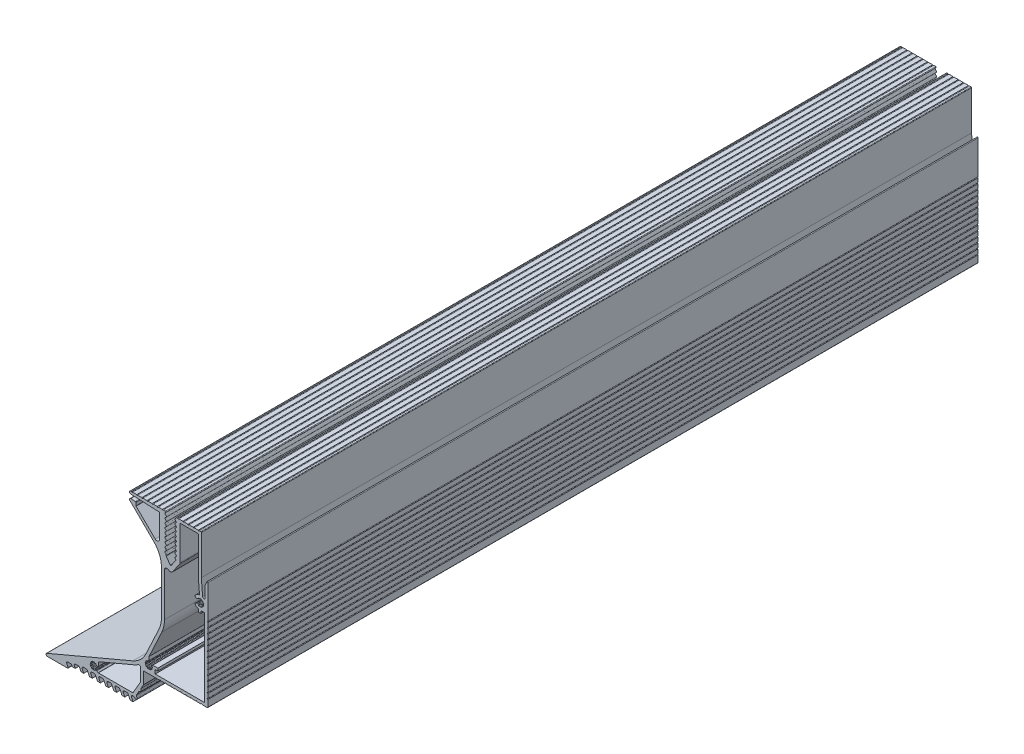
from build123d import *

# Parameters (mm, degrees)
EXTRUDE_1_DEPTH = 300


with BuildPart() as part:
    # Model → Extrude 1 (new body)
    with BuildSketch(Plane.XY):
        with BuildLine():
            Line((322.831339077, 468.657038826), (323.237241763, 468.657057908))
            ThreePointArc((323.237241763, 468.657057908), (323.437241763, 468.457057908), (323.637241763, 468.657057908))
            Line((323.637241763, 468.657057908), (325.237241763, 468.657057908))
            ThreePointArc((325.237241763, 468.657057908), (325.437241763, 468.457057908), (325.637241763, 468.657057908))
            Line((325.637241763, 468.657057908), (327.237241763, 468.657057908))
            ThreePointArc((327.237241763, 468.657057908), (327.437241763, 468.457057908), (327.637241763, 468.657057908))
            Line((327.637241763, 468.657057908), (329.237241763, 468.657057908))
            ThreePointArc((329.237241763, 468.657057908), (329.437241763, 468.457057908), (329.637241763, 468.657057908))
            Line((329.637241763, 468.657057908), (331.241359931, 468.657057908))
            ThreePointArc((331.241359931, 468.657057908), (331.441359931, 468.457057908), (331.641359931, 468.657057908))
            Line((331.641359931, 468.657057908), (332.221359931, 468.657057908))
            ThreePointArc((332.221359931, 468.657057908), (332.362781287, 468.598479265), (332.421359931, 468.457057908))
            Line((332.421359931, 468.457057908), (332.421359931, 453.22413918))
            ThreePointArc((332.421359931, 453.22413918), (332.421519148, 453.216160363), (332.421996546, 453.20819425))
            Line((332.421996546, 453.20819425), (332.909102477, 447.117789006))
            ThreePointArc((332.909102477, 447.117789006), (333.435438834, 446.631867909), (333.921359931, 447.158204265))
            Line((333.921359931, 447.158204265), (333.921359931, 451.445025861))
            ThreePointArc((333.921359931, 451.445025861), (333.92580803, 451.486971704), (333.938954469, 451.527051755))
            Line((333.938954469, 451.527051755), (334.538954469, 452.861304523))
            ThreePointArc((334.538954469, 452.861304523), (334.771170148, 453.011494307), (334.921359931, 452.779278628))
            Line((334.921359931, 452.779278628), (334.921359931, 439.737948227))
            ThreePointArc((334.921359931, 439.737948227), (334.721359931, 439.537948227), (334.921359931, 439.337948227))
            Line((334.921359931, 439.337948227), (334.921359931, 437.737948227))
            ThreePointArc((334.921359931, 437.737948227), (334.721359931, 437.537948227), (334.921359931, 437.337948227))
            Line((334.921359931, 437.337948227), (334.921359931, 435.737948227))
            ThreePointArc((334.921359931, 435.737948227), (334.721359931, 435.537948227), (334.921359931, 435.337948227))
            Line((334.921359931, 435.337948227), (334.921359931, 433.737948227))
            ThreePointArc((334.921359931, 433.737948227), (334.721359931, 433.537948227), (334.921359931, 433.337948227))
            Line((334.921359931, 433.337948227), (334.921359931, 431.737948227))
            ThreePointArc((334.921359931, 431.737948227), (334.721359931, 431.537948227), (334.921359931, 431.337948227))
            Line((334.921359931, 431.337948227), (334.921359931, 429.737948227))
            ThreePointArc((334.921359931, 429.737948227), (334.721359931, 429.537948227), (334.921359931, 429.337948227))
            Line((334.921359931, 429.337948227), (334.921359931, 427.737948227))
            ThreePointArc((334.921359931, 427.737948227), (334.721359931, 427.537948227), (334.921359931, 427.337948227))
            Line((334.921359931, 427.337948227), (334.921359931, 425.737948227))
            ThreePointArc((334.921359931, 425.737948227), (334.721359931, 425.537948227), (334.921359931, 425.337948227))
            Line((334.921359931, 425.337948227), (334.921359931, 423.737948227))
            ThreePointArc((334.921359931, 423.737948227), (334.721359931, 423.537948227), (334.921359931, 423.337948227))
            Line((334.921359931, 423.337948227), (334.921359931, 421.737948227))
            ThreePointArc((334.921359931, 421.737948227), (334.721359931, 421.537948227), (334.921359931, 421.337948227))
            Line((334.921359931, 421.337948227), (334.921359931, 419.737948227))
            ThreePointArc((334.921359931, 419.737948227), (334.721359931, 419.537948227), (334.921359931, 419.337948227))
            Line((334.921359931, 419.337948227), (334.921359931, 417.737948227))
            ThreePointArc((334.921359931, 417.737948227), (334.721359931, 417.537948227), (334.921359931, 417.337948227))
            Line((334.921359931, 417.337948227), (334.921359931, 415.737948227))
            ThreePointArc((334.921359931, 415.737948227), (334.721359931, 415.537948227), (334.921359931, 415.337948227))
            Line((334.921359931, 415.337948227), (334.921359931, 413.737948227))
            ThreePointArc((334.921359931, 413.737948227), (334.721359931, 413.537948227), (334.921359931, 413.337948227))
            Line((334.921359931, 413.337948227), (334.921359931, 410.737948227))
            ThreePointArc((334.921359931, 410.737948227), (334.862781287, 410.596526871), (334.721359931, 410.537948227))
            Line((334.721359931, 410.537948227), (332.641359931, 410.537948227))
            ThreePointArc((332.641359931, 410.537948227), (332.441359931, 410.737948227), (332.241359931, 410.537948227))
            Line((332.241359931, 410.537948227), (330.644401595, 410.537948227))
            ThreePointArc((330.644401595, 410.537948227), (330.444401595, 410.737948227), (330.244401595, 410.537948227))
            Line((330.244401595, 410.537948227), (328.644401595, 410.537948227))
            ThreePointArc((328.644401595, 410.537948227), (328.444401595, 410.737948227), (328.244401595, 410.537948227))
            Line((328.244401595, 410.537948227), (326.644401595, 410.537948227))
            ThreePointArc((326.644401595, 410.537948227), (326.444401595, 410.737948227), (326.244401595, 410.537948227))
            Line((326.244401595, 410.537948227), (324.644401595, 410.537948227))
            ThreePointArc((324.644401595, 410.537948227), (324.444401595, 410.737948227), (324.244401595, 410.537948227))
            Line((324.244401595, 410.537948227), (322.644401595, 410.537948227))
            ThreePointArc((322.644401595, 410.537948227), (322.444401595, 410.737948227), (322.244401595, 410.537948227))
            Line((322.244401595, 410.537948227), (320.644401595, 410.537948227))
            ThreePointArc((320.644401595, 410.537948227), (320.444401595, 410.737948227), (320.244401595, 410.537948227))
            Line((320.244401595, 410.537948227), (318.644401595, 410.537948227))
            ThreePointArc((318.644401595, 410.537948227), (318.444401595, 410.737948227), (318.244401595, 410.537948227))
            Line((318.244401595, 410.537948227), (316.644401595, 410.537948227))
            ThreePointArc((316.644401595, 410.537948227), (316.444401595, 410.737948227), (316.244401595, 410.537948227))
            Line((316.244401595, 410.537948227), (310.121359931, 410.537948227))
            ThreePointArc((310.121359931, 410.537948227), (309.979938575, 410.479369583), (309.921359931, 410.337948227))
            Line((309.921359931, 410.337948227), (309.921359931, 405.899680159))
            ThreePointArc((309.921359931, 405.899680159), (309.914545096, 405.84791635), (309.894565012, 405.799680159))
            Line((309.894565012, 405.799680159), (308.894300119, 404.067170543))
            ThreePointArc((308.894300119, 404.067170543), (308.827396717, 403.826329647), (308.885433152, 403.583199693))
            ThreePointArc((308.885433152, 403.583199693), (308.876566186, 403.099228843), (308.461868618, 402.8495644))
            ThreePointArc((308.461868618, 402.8495644), (308.222293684, 402.778260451), (308.047171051, 402.599899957))
            Line((308.047171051, 402.599899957), (307.190892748, 401.116782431))
            ThreePointArc((307.190892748, 401.116782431), (307.124381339, 400.888592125), (307.170751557, 400.6554733))
            Line((307.170751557, 400.6554733), (307.401333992, 400.160987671))
            ThreePointArc((307.401333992, 400.160987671), (307.15948923, 399.496524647), (306.495026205, 399.738369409))
            Line((306.495026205, 399.738369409), (306.489778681, 399.749622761))
            ThreePointArc((306.489778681, 399.749622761), (306.305274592, 399.960009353), (306.036624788, 400.038313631))
            Line((306.036624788, 400.038313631), (305.63289134, 400.038313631))
            ThreePointArc((305.63289134, 400.038313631), (305.211195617, 399.806963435), (305.179737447, 399.3270045))
            Line((305.179737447, 399.3270045), (305.780834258, 398.037948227))
            Line((305.780834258, 398.037948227), (304.677456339, 398.037948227))
            Line((304.677456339, 398.037948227), (303.879289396, 399.749622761))
            ThreePointArc((303.879289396, 399.749622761), (303.694785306, 399.960009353), (303.426135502, 400.038313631))
            Line((303.426135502, 400.038313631), (302.46389134, 400.038313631))
            ThreePointArc((302.46389134, 400.038313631), (302.042195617, 399.806963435), (302.010737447, 399.3270045))
            Line((302.010737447, 399.3270045), (302.611834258, 398.037948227))
            Line((302.611834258, 398.037948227), (301.508456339, 398.037948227))
            Line((301.508456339, 398.037948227), (300.710289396, 399.749622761))
            ThreePointArc((300.710289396, 399.749622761), (300.525785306, 399.960009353), (300.257135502, 400.038313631))
            Line((300.257135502, 400.038313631), (299.29489134, 400.038313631))
            ThreePointArc((299.29489134, 400.038313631), (298.873195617, 399.806963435), (298.841737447, 399.3270045))
            Line((298.841737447, 399.3270045), (299.442834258, 398.037948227))
            Line((299.442834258, 398.037948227), (298.339456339, 398.037948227))
            Line((298.339456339, 398.037948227), (297.541289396, 399.749622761))
            ThreePointArc((297.541289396, 399.749622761), (297.356785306, 399.960009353), (297.088135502, 400.038313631))
            Line((297.088135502, 400.038313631), (296.12589134, 400.038313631))
            ThreePointArc((296.12589134, 400.038313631), (295.704195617, 399.806963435), (295.672737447, 399.3270045))
            Line((295.672737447, 399.3270045), (296.273834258, 398.037948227))
            Line((296.273834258, 398.037948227), (295.170456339, 398.037948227))
            Line((295.170456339, 398.037948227), (294.372289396, 399.749622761))
            ThreePointArc((294.372289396, 399.749622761), (294.187785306, 399.960009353), (293.919135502, 400.038313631))
            Line((293.919135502, 400.038313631), (292.95689134, 400.038313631))
            ThreePointArc((292.95689134, 400.038313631), (292.535195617, 399.806963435), (292.503737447, 399.3270045))
            Line((292.503737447, 399.3270045), (293.104834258, 398.037948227))
            Line((293.104834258, 398.037948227), (292.001456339, 398.037948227))
            Line((292.001456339, 398.037948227), (291.203289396, 399.749622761))
            ThreePointArc((291.203289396, 399.749622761), (291.018785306, 399.960009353), (290.750135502, 400.038313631))
            Line((290.750135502, 400.038313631), (289.78789134, 400.038313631))
            ThreePointArc((289.78789134, 400.038313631), (289.366195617, 399.806963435), (289.334737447, 399.3270045))
            Line((289.334737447, 399.3270045), (289.935834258, 398.037948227))
            Line((289.935834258, 398.037948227), (288.832456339, 398.037948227))
            Line((288.832456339, 398.037948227), (288.034289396, 399.749622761))
            ThreePointArc((288.034289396, 399.749622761), (287.849785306, 399.960009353), (287.581135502, 400.038313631))
            Line((287.581135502, 400.038313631), (286.477757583, 400.038313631))
            ThreePointArc((286.477757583, 400.038313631), (286.05606186, 399.806963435), (286.02460369, 399.3270045))
            Line((286.02460369, 399.3270045), (286.625700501, 398.037948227))
            Line((286.625700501, 398.037948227), (285.522322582, 398.037948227))
            Line((285.522322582, 398.037948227), (284.952095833, 399.260803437))
            ThreePointArc((284.952095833, 399.260803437), (284.767591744, 399.471190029), (284.49894194, 399.549494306))
            Line((284.49894194, 399.549494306), (283.395564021, 399.549494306))
            ThreePointArc((283.395564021, 399.549494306), (282.973868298, 399.31814411), (282.942410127, 398.838185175))
            Line((282.942410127, 398.838185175), (283.315566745, 398.037948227))
            Line((283.315566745, 398.037948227), (282.212188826, 398.037948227))
            Line((282.212188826, 398.037948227), (281.994384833, 398.505030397))
            ThreePointArc((281.994384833, 398.505030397), (281.809880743, 398.715416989), (281.541230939, 398.793721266))
            Line((281.541230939, 398.793721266), (280.43785302, 398.793721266))
            ThreePointArc((280.43785302, 398.793721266), (280.016157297, 398.562371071), (279.984699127, 398.082412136))
            Line((279.984699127, 398.082412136), (280.518767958, 396.937097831))
            ThreePointArc((280.518767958, 396.937097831), (280.50618469, 396.745114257), (280.337506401, 396.652574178))
            Line((280.337506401, 396.652574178), (272.418156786, 396.652574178))
            ThreePointArc((272.418156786, 396.652574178), (271.92816661, 397.053027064), (272.223048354, 397.612935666))
            Line((272.223048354, 397.612935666), (305.721136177, 411.809951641))
            ThreePointArc((305.721136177, 411.809951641), (308.763541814, 413.821843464), (310.882045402, 416.790998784))
            Line((310.882045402, 416.790998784), (315.924437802, 427.604444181))
            ThreePointArc((315.924437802, 427.604444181), (316.624320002, 429.666230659), (316.861359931, 431.830626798))
            Line((316.861359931, 431.830626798), (316.861359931, 449.047517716))
            ThreePointArc((316.861359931, 449.047517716), (316.085510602, 452.909517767), (313.878351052, 456.172251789))
            Line((313.878351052, 456.172251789), (304.61185251, 465.298618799))
            ThreePointArc((304.61185251, 465.298618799), (304.504115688, 465.854100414), (304.983675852, 466.154415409))
            Line((304.983675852, 466.154415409), (306.77109158, 466.079371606))
            ThreePointArc((306.77109158, 466.079371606), (306.907059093, 466.017971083), (306.962702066, 465.879547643))
            Line((306.962702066, 465.879547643), (306.962702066, 464.751329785))
            ThreePointArc((306.962702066, 464.751329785), (306.978219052, 464.674089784), (307.022362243, 464.608835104))
            Line((307.022362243, 464.608835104), (314.459660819, 457.284006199))
            ThreePointArc((314.459660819, 457.284006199), (315.547559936, 457.074064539), (316.161359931, 457.996479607))
            Line((316.161359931, 457.996479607), (316.161359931, 466.99466779))
            ThreePointArc((316.161359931, 466.99466779), (316.105716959, 467.133091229), (315.969749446, 467.194491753))
            Line((315.969749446, 467.194491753), (304.941728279, 467.657498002))
            ThreePointArc((304.941728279, 467.657498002), (304.452435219, 468.167764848), (304.962702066, 468.657057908))
            Line((304.962702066, 468.657057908), (305.262702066, 468.657057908))
            ThreePointArc((305.262702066, 468.657057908), (305.462702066, 468.457057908), (305.662702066, 468.657057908))
            Line((305.662702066, 468.657057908), (307.262702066, 468.657057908))
            ThreePointArc((307.262702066, 468.657057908), (307.462702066, 468.457057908), (307.662702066, 468.657057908))
            Line((307.662702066, 468.657057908), (309.262702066, 468.657057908))
            ThreePointArc((309.262702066, 468.657057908), (309.462702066, 468.457057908), (309.662702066, 468.657057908))
            Line((309.662702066, 468.657057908), (311.262702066, 468.657057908))
            ThreePointArc((311.262702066, 468.657057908), (311.462702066, 468.457057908), (311.662702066, 468.657057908))
            Line((311.662702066, 468.657057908), (313.262702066, 468.657057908))
            ThreePointArc((313.262702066, 468.657057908), (313.462702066, 468.457057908), (313.662702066, 468.657057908))
            Line((313.662702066, 468.657057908), (315.262702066, 468.657057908))
            ThreePointArc((315.262702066, 468.657057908), (315.462702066, 468.457057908), (315.662702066, 468.657057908))
            Line((315.662702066, 468.657057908), (317.262702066, 468.657057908))
            ThreePointArc((317.262702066, 468.657057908), (317.462700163, 468.457056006), (317.662702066, 468.657054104))
            Line((317.662702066, 468.657054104), (318.465857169, 468.657038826))
            ThreePointArc((318.465857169, 468.657038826), (318.656621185, 468.523404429), (318.589990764, 468.300224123))
            ThreePointArc((318.589990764, 468.300224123), (318.55255359, 468.273550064), (318.512616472, 468.250788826))
            ThreePointArc((318.512616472, 468.250788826), (318.262448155, 467.844538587), (318.512616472, 467.438288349))
            ThreePointArc((318.512616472, 467.438288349), (318.767160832, 467.03203811), (318.512616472, 466.625787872))
            ThreePointArc((318.512616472, 466.625787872), (318.262616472, 466.219537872), (318.512616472, 465.813287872))
            ThreePointArc((318.512616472, 465.813287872), (318.762641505, 465.407037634), (318.512616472, 465.000787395))
            ThreePointArc((318.512616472, 465.000787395), (318.262616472, 464.594537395), (318.512616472, 464.188287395))
            ThreePointArc((318.512616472, 464.188287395), (318.762636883, 463.782037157), (318.512616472, 463.375786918))
            ThreePointArc((318.512616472, 463.375786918), (318.262616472, 462.969536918), (318.512616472, 462.563286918))
            ThreePointArc((318.512616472, 462.563286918), (318.762623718, 462.15703668), (318.512616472, 461.750786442))
            ThreePointArc((318.512616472, 461.750786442), (318.262616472, 461.344536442), (318.512616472, 460.938286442))
            ThreePointArc((318.512616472, 460.938286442), (318.762630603, 460.532036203), (318.512616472, 460.125785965))
            ThreePointArc((318.512616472, 460.125785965), (318.262616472, 459.719535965), (318.512616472, 459.313285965))
            ThreePointArc((318.512616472, 459.313285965), (318.762634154, 458.907035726), (318.512616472, 458.500785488))
            ThreePointArc((318.512616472, 458.500785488), (318.262616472, 458.094535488), (318.512616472, 457.688285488))
            ThreePointArc((318.512616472, 457.688285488), (318.762694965, 457.28203525), (318.512616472, 456.875785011))
            ThreePointArc((318.512616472, 456.875785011), (318.262616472, 456.469535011), (318.512616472, 456.063285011))
            ThreePointArc((318.512616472, 456.063285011), (318.762628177, 455.657034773), (318.512616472, 455.250784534))
            ThreePointArc((318.512616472, 455.250784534), (318.262616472, 454.844534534), (318.512616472, 454.438284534))
            ThreePointArc((318.512616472, 454.438284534), (318.737637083, 454.18074772), (318.719756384, 453.839222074))
            ThreePointArc((318.719756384, 453.839222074), (318.701628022, 453.737639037), (318.736549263, 453.640539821))
            Line((318.736549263, 453.640539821), (320.293788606, 451.394156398))
            ThreePointArc((320.293788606, 451.394156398), (320.458156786, 451.308099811), (320.622524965, 451.394156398))
            Line((320.622524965, 451.394156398), (322.517405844, 454.127601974))
            ThreePointArc((322.517405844, 454.127601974), (322.549848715, 454.277117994), (322.467119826, 454.405817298))
            ThreePointArc((322.467119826, 454.405817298), (322.440434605, 454.423001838), (322.412616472, 454.438284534))
            ThreePointArc((322.412616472, 454.438284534), (322.162602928, 454.844534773), (322.412616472, 455.250785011))
            ThreePointArc((322.412616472, 455.250785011), (322.662616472, 455.657035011), (322.412616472, 456.063285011))
            ThreePointArc((322.412616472, 456.063285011), (322.162597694, 456.46953525), (322.412616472, 456.875785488))
            ThreePointArc((322.412616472, 456.875785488), (322.662616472, 457.282035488), (322.412616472, 457.688285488))
            ThreePointArc((322.412616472, 457.688285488), (322.162570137, 458.094535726), (322.412616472, 458.500785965))
            ThreePointArc((322.412616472, 458.500785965), (322.662616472, 458.907035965), (322.412616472, 459.313285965))
            ThreePointArc((322.412616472, 459.313285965), (322.162603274, 459.719536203), (322.412616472, 460.125786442))
            ThreePointArc((322.412616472, 460.125786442), (322.662616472, 460.532036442), (322.412616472, 460.938286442))
            ThreePointArc((322.412616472, 460.938286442), (322.162578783, 461.34453668), (322.412616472, 461.750786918))
            ThreePointArc((322.412616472, 461.750786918), (322.662616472, 462.157036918), (322.412616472, 462.563286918))
            ThreePointArc((322.412616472, 462.563286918), (322.162614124, 462.969537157), (322.412616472, 463.375787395))
            ThreePointArc((322.412616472, 463.375787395), (322.662616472, 463.782037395), (322.412616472, 464.188287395))
            ThreePointArc((322.412616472, 464.188287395), (322.162610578, 464.594537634), (322.412616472, 465.000787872))
            ThreePointArc((322.412616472, 465.000787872), (322.662616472, 465.407037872), (322.412616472, 465.813287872))
            ThreePointArc((322.412616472, 465.813287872), (322.16258409, 466.21953811), (322.412616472, 466.625788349))
            ThreePointArc((322.412616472, 466.625788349), (322.662616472, 467.032038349), (322.412616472, 467.438288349))
            ThreePointArc((322.412616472, 467.438288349), (322.161700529, 467.844538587), (322.412616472, 468.250788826))
            ThreePointArc((322.412616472, 468.250788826), (322.553604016, 468.361514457), (322.640888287, 468.518100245))
            ThreePointArc((322.640888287, 468.518100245), (322.713412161, 468.618687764), (322.831339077, 468.657038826))
        make_face()
        with BuildLine():
            Line((291.767894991, 401.451691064), (292.204775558, 401.085104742))
            ThreePointArc((292.204775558, 401.085104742), (292.264929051, 401.050375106), (292.33333308, 401.038313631))
            Line((292.33333308, 401.038313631), (305.471272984, 401.038313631))
            ThreePointArc((305.471272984, 401.038313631), (305.721272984, 401.105300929), (305.904285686, 401.288313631))
            Line((305.904285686, 401.288313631), (308.654372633, 406.051603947))
            ThreePointArc((308.654372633, 406.051603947), (308.704322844, 406.172194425), (308.721359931, 406.301603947))
            Line((308.721359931, 406.301603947), (308.721359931, 411.22435895))
            ThreePointArc((308.721359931, 411.22435895), (308.459264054, 411.66413347), (307.947753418, 411.642855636))
            ThreePointArc((307.947753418, 411.642855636), (307.089473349, 411.134784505), (306.189396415, 410.70508407))
            Line((306.189396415, 410.70508407), (292.539677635, 404.920118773))
            ThreePointArc((292.539677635, 404.920118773), (292.450974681, 404.846408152), (292.417721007, 404.735974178))
            Line((292.417721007, 404.735974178), (292.417721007, 403.378696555))
            ThreePointArc((292.417721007, 403.378696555), (292.382987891, 403.266060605), (292.290852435, 403.192546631))
            Line((292.290852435, 403.192546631), (292.036178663, 403.092494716))
            ThreePointArc((292.036178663, 403.092494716), (291.89009215, 403.092423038), (291.782930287, 403.191708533))
            ThreePointArc((291.782930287, 403.191708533), (291.716633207, 403.259826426), (291.622712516, 403.274463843))
            ThreePointArc((291.622712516, 403.274463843), (291.44991822, 403.33456164), (291.407948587, 403.512629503))
            ThreePointArc((291.407948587, 403.512629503), (291.349626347, 403.675592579), (291.176541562, 403.675268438))
            ThreePointArc((291.176541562, 403.675268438), (290.994784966, 403.654444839), (290.87970974, 403.796665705))
            ThreePointArc((290.87970974, 403.796665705), (290.756456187, 403.91818529), (290.600652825, 403.842794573))
            ThreePointArc((290.600652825, 403.842794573), (290.446441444, 403.745203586), (290.281146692, 403.822552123))
            ThreePointArc((290.281146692, 403.822552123), (290.117252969, 403.879570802), (290.009108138, 403.743861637))
            ThreePointArc((290.009108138, 403.743861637), (289.912066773, 403.588772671), (289.729124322, 403.587479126))
            ThreePointArc((289.729124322, 403.587479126), (289.557269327, 403.566881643), (289.519070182, 403.398064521))
            ThreePointArc((289.519070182, 403.398064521), (289.498927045, 403.216231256), (289.334665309, 403.135688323))
            ThreePointArc((289.334665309, 403.135688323), (289.188758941, 403.042568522), (289.227596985, 402.873892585))
            ThreePointArc((289.227596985, 402.873892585), (289.288342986, 402.701326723), (289.175294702, 402.557489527))
            ThreePointArc((289.175294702, 402.557489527), (289.084248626, 402.410285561), (289.19241839, 402.275164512))
            ThreePointArc((289.19241839, 402.275164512), (289.322022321, 402.146044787), (289.282577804, 401.967402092))
            ThreePointArc((289.282577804, 401.967402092), (289.264417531, 401.79527249), (289.420501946, 401.720465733))
            ThreePointArc((289.420501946, 401.720465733), (289.593294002, 401.660365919), (289.63526588, 401.482300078))
            ThreePointArc((289.63526588, 401.482300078), (289.693556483, 401.319291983), (289.866672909, 401.319661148))
            ThreePointArc((289.866672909, 401.319661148), (290.048427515, 401.340479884), (290.163504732, 401.198263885))
            ThreePointArc((290.163504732, 401.198263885), (290.28675833, 401.07674456), (290.442561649, 401.15213502))
            ThreePointArc((290.442561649, 401.15213502), (290.597283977, 401.249752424), (290.762670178, 401.171550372))
            ThreePointArc((290.762670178, 401.171550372), (290.926458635, 401.115489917), (291.034106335, 401.251067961))
            ThreePointArc((291.034106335, 401.251067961), (291.131151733, 401.406149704), (291.31409015, 401.407450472))
            ThreePointArc((291.31409015, 401.407450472), (291.409054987, 401.391290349), (291.494287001, 401.436178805))
            ThreePointArc((291.494287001, 401.436178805), (291.62801661, 401.498161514), (291.767894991, 401.451691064))
        make_face(mode=Mode.SUBTRACT)
        with BuildLine():
            Line((330.015548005, 443.363026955), (330.586933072, 443.704768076))
            ThreePointArc((330.586933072, 443.704768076), (330.736261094, 443.727603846), (330.858963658, 443.639487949))
            ThreePointArc((330.858963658, 443.639487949), (330.937221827, 443.577381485), (331.037126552, 443.578155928))
            ThreePointArc((331.037126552, 443.578155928), (331.217866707, 443.549851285), (331.290943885, 443.382137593))
            ThreePointArc((331.290943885, 443.382137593), (331.377387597, 443.232147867), (331.547659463, 443.263403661))
            ThreePointArc((331.547659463, 443.263403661), (331.72278273, 443.316327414), (331.861390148, 443.196924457))
            ThreePointArc((331.861390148, 443.196924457), (332.004350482, 443.099350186), (332.144199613, 443.201333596))
            ThreePointArc((332.144199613, 443.201333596), (332.279017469, 443.324999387), (332.455705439, 443.277560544))
            ThreePointArc((332.455705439, 443.277560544), (332.626844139, 443.251677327), (332.708594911, 443.404239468))
            ThreePointArc((332.708594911, 443.404239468), (332.776405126, 443.574153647), (332.956178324, 443.608074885))
            ThreePointArc((332.956178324, 443.608074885), (333.121605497, 443.659004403), (333.129059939, 443.831933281))
            ThreePointArc((333.129059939, 443.831933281), (333.116431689, 444.014442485), (333.263684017, 444.123005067))
            ThreePointArc((333.263684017, 444.123005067), (333.390623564, 444.240668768), (333.322316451, 444.399705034))
            ThreePointArc((333.322316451, 444.399705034), (333.231747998, 444.558660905), (333.317317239, 444.72036285))
            ThreePointArc((333.317317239, 444.72036285), (333.380633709, 444.881451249), (333.250087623, 444.995100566))
            ThreePointArc((333.250087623, 444.995100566), (333.099519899, 445.09901868), (333.10645528, 445.2818342))
            ThreePointArc((333.10645528, 445.2818342), (333.093607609, 445.454441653), (332.926679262, 445.500194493))
            ThreePointArc((332.926679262, 445.500194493), (332.745935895, 445.52849498), (332.672861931, 445.696212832))
            ThreePointArc((332.672861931, 445.696212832), (332.586398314, 445.846159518), (332.416146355, 445.814946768))
            ThreePointArc((332.416146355, 445.814946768), (332.241023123, 445.762023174), (332.102415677, 445.881425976))
            ThreePointArc((332.102415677, 445.881425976), (331.959455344, 445.979000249), (331.81960621, 445.87701684))
            ThreePointArc((331.81960621, 445.87701684), (331.684788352, 445.753351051), (331.508100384, 445.800789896))
            ThreePointArc((331.508100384, 445.800789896), (331.336961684, 445.826673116), (331.255210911, 445.674110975))
            ThreePointArc((331.255210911, 445.674110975), (331.187400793, 445.504196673), (331.007627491, 445.470275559))
            ThreePointArc((331.007627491, 445.470275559), (330.907821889, 445.468005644), (330.831521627, 445.403627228))
            ThreePointArc((330.831521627, 445.403627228), (330.71161468, 445.311853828), (330.561731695, 445.330160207))
            Line((330.561731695, 445.330160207), (329.980155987, 445.654082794))
            ThreePointArc((329.980155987, 445.654082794), (329.882910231, 445.782495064), (329.911870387, 445.940949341))
            ThreePointArc((329.911870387, 445.940949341), (330.616449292, 446.633353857), (331.534227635, 446.998782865))
            ThreePointArc((331.534227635, 446.998782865), (331.656964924, 447.073643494), (331.697776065, 447.211494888))
            Line((331.697776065, 447.211494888), (331.221359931, 453.168242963))
            Line((331.221359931, 453.168242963), (331.221359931, 467.257057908))
            ThreePointArc((331.221359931, 467.257057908), (331.162781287, 467.398479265), (331.021359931, 467.457057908))
            Line((331.021359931, 467.457057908), (324.358157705, 467.457057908))
            ThreePointArc((324.358157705, 467.457057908), (324.216736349, 467.398479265), (324.158157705, 467.257057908))
            Line((324.158157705, 467.257057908), (324.158157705, 454.174284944))
            ThreePointArc((324.158157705, 454.174284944), (324.112579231, 453.875822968), (323.979998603, 453.604567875))
            Line((323.979998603, 453.604567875), (321.200433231, 449.594927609))
            ThreePointArc((321.200433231, 449.594927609), (320.501111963, 449.172178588), (319.719976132, 449.412165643))
            ThreePointArc((319.719976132, 449.412165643), (318.648211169, 449.570350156), (318.061359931, 448.659686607))
            Line((318.061359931, 448.659686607), (318.061359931, 431.830626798))
            ThreePointArc((318.061359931, 431.830626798), (317.795875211, 429.406503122), (317.012007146, 427.097302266))
            Line((317.012007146, 427.097302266), (312.069940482, 416.499006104))
            ThreePointArc((312.069940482, 416.499006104), (312.055942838, 416.457770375), (312.05120204, 416.414482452))
            Line((312.05120204, 416.414482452), (312.05120204, 415.108649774))
            ThreePointArc((312.05120204, 415.108649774), (311.986351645, 414.961176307), (311.833793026, 414.909408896))
            ThreePointArc((311.833793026, 414.909408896), (311.732679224, 414.881434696), (311.67459317, 414.794070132))
            ThreePointArc((311.67459317, 414.794070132), (311.552250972, 414.658050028), (311.37182915, 414.688332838))
            ThreePointArc((311.37182915, 414.688332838), (311.198997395, 414.697691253), (311.132247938, 414.537994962))
            ThreePointArc((311.132247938, 414.537994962), (311.081038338, 414.362362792), (310.905344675, 414.311364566))
            ThreePointArc((310.905344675, 414.311364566), (310.745568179, 414.244807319), (310.754718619, 414.071964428))
            ThreePointArc((310.754718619, 414.071964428), (310.784784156, 413.891506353), (310.648617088, 413.769327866))
            ThreePointArc((310.648617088, 413.769327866), (310.533533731, 413.640038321), (310.616779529, 413.488281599))
            ThreePointArc((310.616779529, 413.488281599), (310.722165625, 413.338739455), (310.652494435, 413.169579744))
            ThreePointArc((310.652494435, 413.169579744), (310.604911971, 413.003163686), (310.745751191, 412.902552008))
            ThreePointArc((310.745751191, 412.902552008), (310.905587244, 412.813546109), (310.916208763, 412.630907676))
            ThreePointArc((310.916208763, 412.630907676), (310.945543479, 412.460326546), (311.116089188, 412.430786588))
            ThreePointArc((311.116089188, 412.430786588), (311.298714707, 412.419945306), (311.38752821, 412.260002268))
            ThreePointArc((311.38752821, 412.260002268), (311.487970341, 412.119042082), (311.654443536, 412.166424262))
            ThreePointArc((311.654443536, 412.166424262), (311.823686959, 412.235891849), (311.973102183, 412.130325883))
            ThreePointArc((311.973102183, 412.130325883), (312.124758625, 412.046897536), (312.254186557, 412.161825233))
            ThreePointArc((312.254186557, 412.161825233), (312.376528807, 412.297845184), (312.556950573, 412.267562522))
            ThreePointArc((312.556950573, 412.267562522), (312.729782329, 412.258204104), (312.796531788, 412.417900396))
            ThreePointArc((312.796531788, 412.417900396), (312.847741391, 412.593532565), (313.023435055, 412.644530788))
            ThreePointArc((313.023435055, 412.644530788), (313.183211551, 412.711088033), (313.174061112, 412.883930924))
            ThreePointArc((313.174061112, 412.883930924), (313.143995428, 413.064389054), (313.28016265, 413.186567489))
            ThreePointArc((313.28016265, 413.186567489), (313.39529313, 413.315851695), (313.312000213, 413.467613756))
            ThreePointArc((313.312000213, 413.467613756), (313.206619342, 413.617156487), (313.276285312, 413.786315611))
            ThreePointArc((313.276285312, 413.786315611), (313.327634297, 413.86624292), (313.320708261, 413.9609906))
            ThreePointArc((313.320708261, 413.9609906), (313.338888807, 414.148872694), (313.505309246, 414.237948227))
            Line((313.505309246, 414.237948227), (315.464401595, 414.237948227))
            Line((315.464401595, 414.237948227), (315.464401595, 413.237948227))
            Line((315.464401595, 413.237948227), (314.464401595, 413.237948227))
            Line((314.464401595, 413.237948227), (314.464401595, 411.737948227))
            Line((314.464401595, 411.737948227), (333.521359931, 411.737948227))
            ThreePointArc((333.521359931, 411.737948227), (333.662781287, 411.796526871), (333.721359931, 411.937948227))
            Line((333.721359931, 411.937948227), (333.721359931, 442.039297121))
            Line((333.721359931, 442.039297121), (332.221359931, 442.039297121))
            Line((332.221359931, 442.039297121), (332.221359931, 441.039297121))
            Line((332.221359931, 441.039297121), (331.221359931, 441.039297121))
            Line((331.221359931, 441.039297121), (331.221359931, 442.015824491))
            ThreePointArc((331.221359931, 442.015824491), (331.186022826, 442.129341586), (331.092498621, 442.202745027))
            ThreePointArc((331.092498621, 442.202745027), (330.460572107, 442.555334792), (329.956144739, 443.074183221))
            ThreePointArc((329.956144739, 443.074183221), (329.921914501, 443.231753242), (330.015548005, 443.363026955))
        make_face(mode=Mode.SUBTRACT)
    extrude(amount=EXTRUDE_1_DEPTH)


solid = part.part
